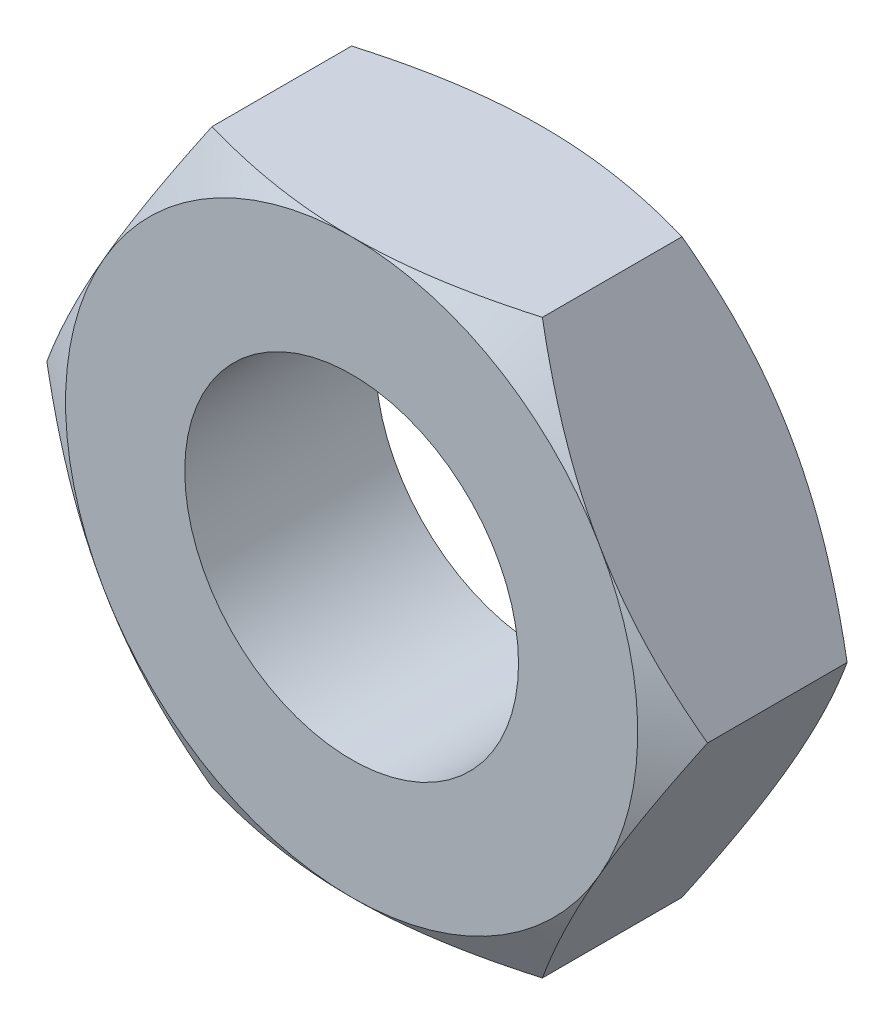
from build123d import *

# Parameters (mm, degrees)
EXTRUDE1_DEPTH = 8
TAPPED_HOLE1_D = 14


with BuildPart() as part:
    # Sketch1 → Extrude1 (new body)
    with BuildSketch(Plane.XY):
        Polygon((6.92820323, -12), (13.856406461, 0), (6.92820323, 12), (-6.92820323, 12), (-13.856406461, 0), (-6.92820323, -12), align=None)
    extrude(amount=EXTRUDE1_DEPTH)

    # Tapped Hole1 (through all)
    with Locations(Plane.XY.offset(8)):
        with Locations((0, 0)):
            Hole(TAPPED_HOLE1_D / 2)

    # Sketch4 → Cut-Revolve1 (revolve, cut)
    with BuildSketch(Plane(origin=(0, 0, 0), x_dir=(1, 0, 0), z_dir=(0, 1, 0)), mode=Mode.PRIVATE) as cut_revolve1_sk:
        Polygon((-13.856406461, -6.92820323), (-12, -8), (-13.856406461, -8), align=None)
        Polygon((-13.856406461, -1.07179677), (-12, 0), (-13.856406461, 0), align=None)
    revolve(cut_revolve1_sk.sketch.rotate(Axis((0, 0, 0), (0, 0, 1)), 180), axis=Axis((0, 0, 0), (0, 0, 1)), mode=Mode.SUBTRACT)


solid = part.part
